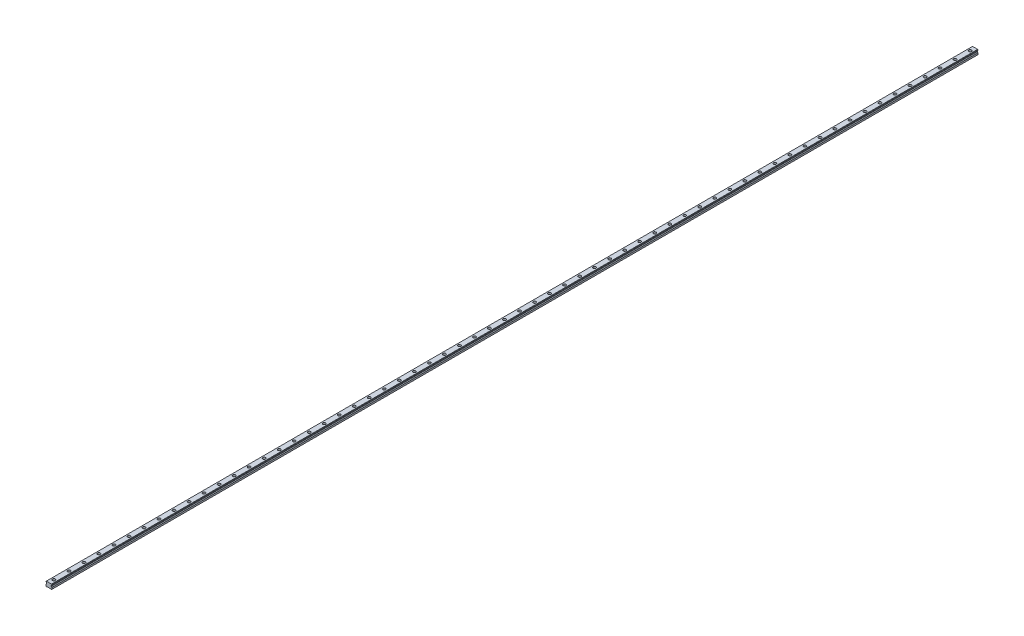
from build123d import *

# Parameters (mm, degrees)
SKETCH1_W           = 23
SKETCH1_H           = 19.2
BOSS_EXTRUDE1_DEPTH = 1850
CUT_EXTRUDE1_DEPTH  = 3701.067687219
CHAMFER1_SIZE       = 1.25
FILLET1_R           = 1.25
CUT_EXTRUDE2_DEPTH  = 3701.067687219
SKETCH4_R           = 5.5
SKETCH4_R_2         = 3.5
CUT_EXTRUDE3_DEPTH  = 9
SKETCH4_2_R         = 3.5
CUT_EXTRUDE4_DEPTH  = 1851.135370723
LPATTERN1_COUNT     = 62
LPATTERN1_PITCH     = 60


with BuildPart() as part:
    # Sketch1 → Boss-Extrude1 (new, symmetric)
    with BuildSketch(Plane.XY):
        with Locations((0, 9.6)):
            Rectangle(SKETCH1_W, SKETCH1_H)
    extrude(amount=BOSS_EXTRUDE1_DEPTH, both=True)

    # Sketch2 → Cut-Extrude1 (cut, through all)
    with BuildSketch(Plane.XY.offset(1850)):
        Polygon((-11.5, 16.7), (-11.5, 7.95), (-8.583333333, 10.866666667), (-8.583333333, 13.783333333), align=None)
        Polygon((8.583333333, 13.783333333), (11.5, 16.7), (11.5, 7.95), (8.583333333, 10.866666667), align=None)
    extrude(amount=-CUT_EXTRUDE1_DEPTH, mode=Mode.SUBTRACT)

    # Chamfer1
    chamfer1_edges = [part.edges().sort_by_distance(p)[0] for p in [
        (-11.5, 19.2, 0),
        (11.5, 19.2, 0),
        (11.5, 0, 0),
        (-11.5, 0, 0),
    ]]
    chamfer(chamfer1_edges, length=CHAMFER1_SIZE)

    # Fillet1
    fillet1_edges = [part.edges().sort_by_distance(p)[0] for p in [
        (-8.583333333, 13.783333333, 0),
        (-8.583333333, 10.866666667, 0),
        (8.583333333, 10.866666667, 0),
        (8.583333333, 13.783333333, 0),
    ]]
    fillet(fillet1_edges, radius=FILLET1_R)

    # Sketch3 → Cut-Extrude2 (cut, through all)
    with BuildSketch(Plane.XY.offset(1850)):
        Polygon((-7, 0), (-5.75, 1.25), (5.75, 1.25), (7, 0), align=None)
    extrude(amount=-CUT_EXTRUDE2_DEPTH, mode=Mode.SUBTRACT)

    # Sketch4 → Cut-Extrude3 (cut)
    with BuildSketch(Plane(origin=(0, 19.2, 0), x_dir=(1, 0, 0), z_dir=(0, 1, 0))):
        with Locations(Location((0, -1830, 0), (0, 0, 270))):
            Circle(SKETCH4_R)
        with Locations(Location((0, -1830, 0), (0, 0, 270))):
            Circle(SKETCH4_R_2, mode=Mode.SUBTRACT)
    cut_extrude3 = extrude(amount=-CUT_EXTRUDE3_DEPTH, mode=Mode.SUBTRACT)

    # Sketch4_2 → Cut-Extrude4 (cut, through all)
    with BuildSketch(Plane(origin=(0, 19.2, 0), x_dir=(1, 0, 0), z_dir=(0, 1, 0))):
        with Locations(Location((0, -1830, 0), (0, 0, 270))):
            Circle(SKETCH4_2_R)
    cut_extrude4 = extrude(amount=-CUT_EXTRUDE4_DEPTH, mode=Mode.SUBTRACT)

    # LPattern1: Cut-Extrude3, Cut-Extrude4 ×62
    with Locations(*[(0, 0, -i * LPATTERN1_PITCH) for i in range(1, LPATTERN1_COUNT)]):
        add(cut_extrude3, mode=Mode.SUBTRACT)
        add(cut_extrude4, mode=Mode.SUBTRACT)


solid = part.part
